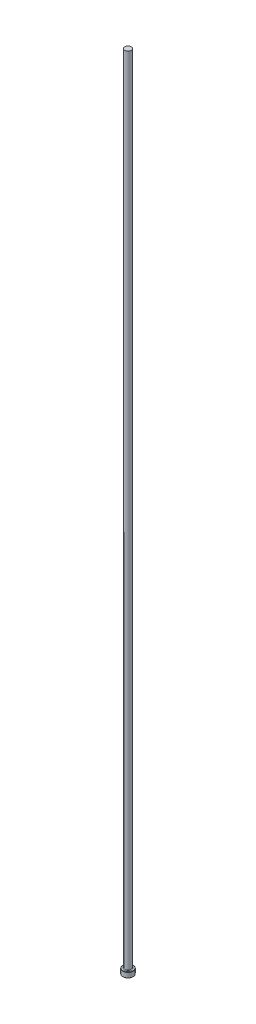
from build123d import *

# Parameters (mm, degrees)
CHAMFER1_SIZE = 0.254
FILLET1_R     = 0.762


with BuildPart() as part:
    # Sketch1 → Revolve1 (revolve)
    with BuildSketch(Plane.XY, mode=Mode.PRIVATE) as revolve1_sk:
        Polygon((0, 0), (-6.35, 0), (-6.35, 6.35), (-3.96875, 6.35), (-3.96875, 990.6), (0, 990.6), align=None)
    revolve(revolve1_sk.sketch.rotate(Axis((0, 259.958771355, 0), (0, -1, 0)), 270), axis=Axis((0, 259.958771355, 0), (0, -1, 0)))

    # Chamfer1
    chamfer1_edges = [part.edges().sort_by_distance(p)[0] for p in [
        (0, 6.35, -6.35),
        (0, 0, -6.35),
    ]]
    chamfer(chamfer1_edges, length=CHAMFER1_SIZE)

    # Fillet1
    fillet1_edges = [part.edges().sort_by_distance(p)[0] for p in [
        (0, 6.35, -3.96875),
    ]]
    fillet(fillet1_edges, radius=FILLET1_R)


solid = part.part
